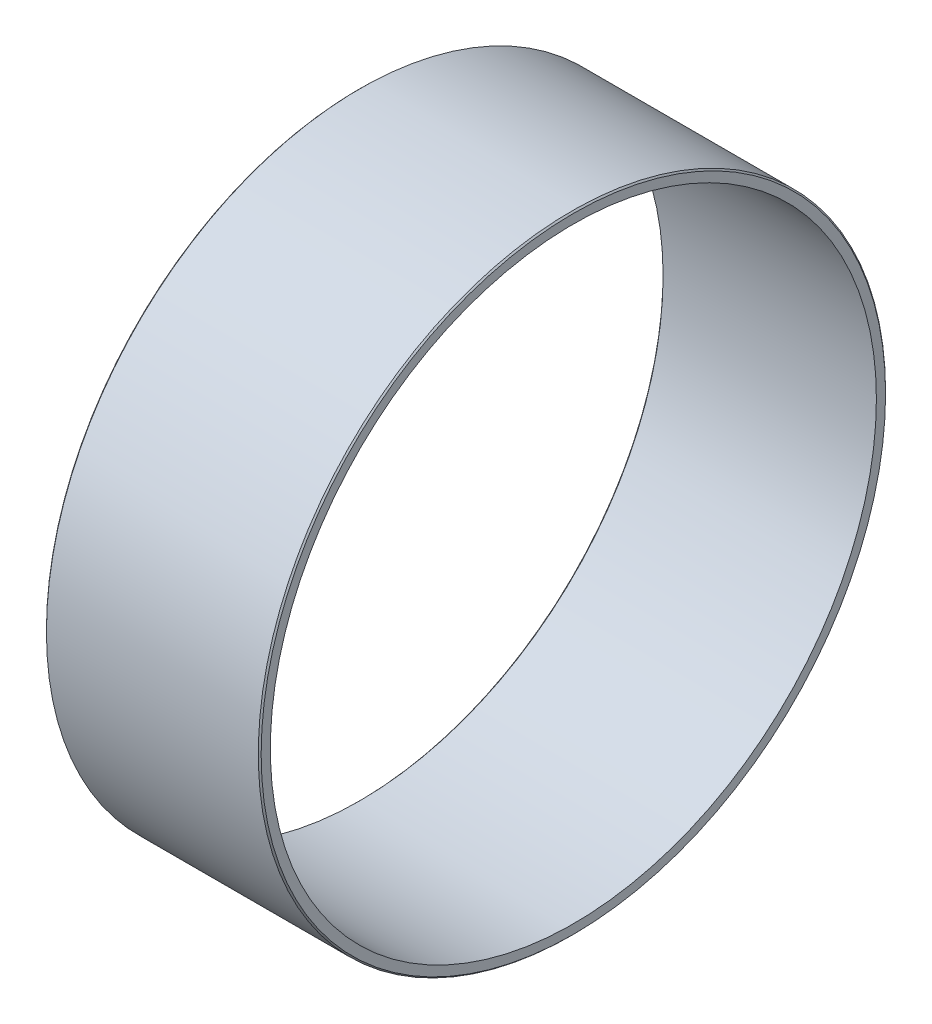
from build123d import *

# Parameters (mm, degrees)
ESQUISSE1_W     = 75
ESQUISSE1_H     = 3.71
CHANFREIN1_SIZE = 0.5
CHANFREIN2_SIZE = 0.5


with BuildPart() as part:
    # Esquisse1 → R_volution1 (revolve)
    with BuildSketch(Plane.XY, mode=Mode.PRIVATE) as r_volution1_sk:
        with Locations((-37.5, 107.695)):
            Rectangle(ESQUISSE1_W, ESQUISSE1_H)
    revolve(r_volution1_sk.sketch.rotate(Axis((0, 0, 0), (-1, 0, 0)), 90), axis=Axis((0, 0, 0), (-1, 0, 0)))

    # Chanfrein1
    chanfrein1_edges = [part.edges().sort_by_distance(p)[0] for p in [
        (-75, 0, 105.84),
        (-75, 0, 109.55),
    ]]
    chamfer(chanfrein1_edges, length=CHANFREIN1_SIZE)

    # Chanfrein2
    chanfrein2_edges = [part.edges().sort_by_distance(p)[0] for p in [
        (0, 0, 109.55),
    ]]
    chamfer(chanfrein2_edges, length=CHANFREIN2_SIZE)


solid = part.part
